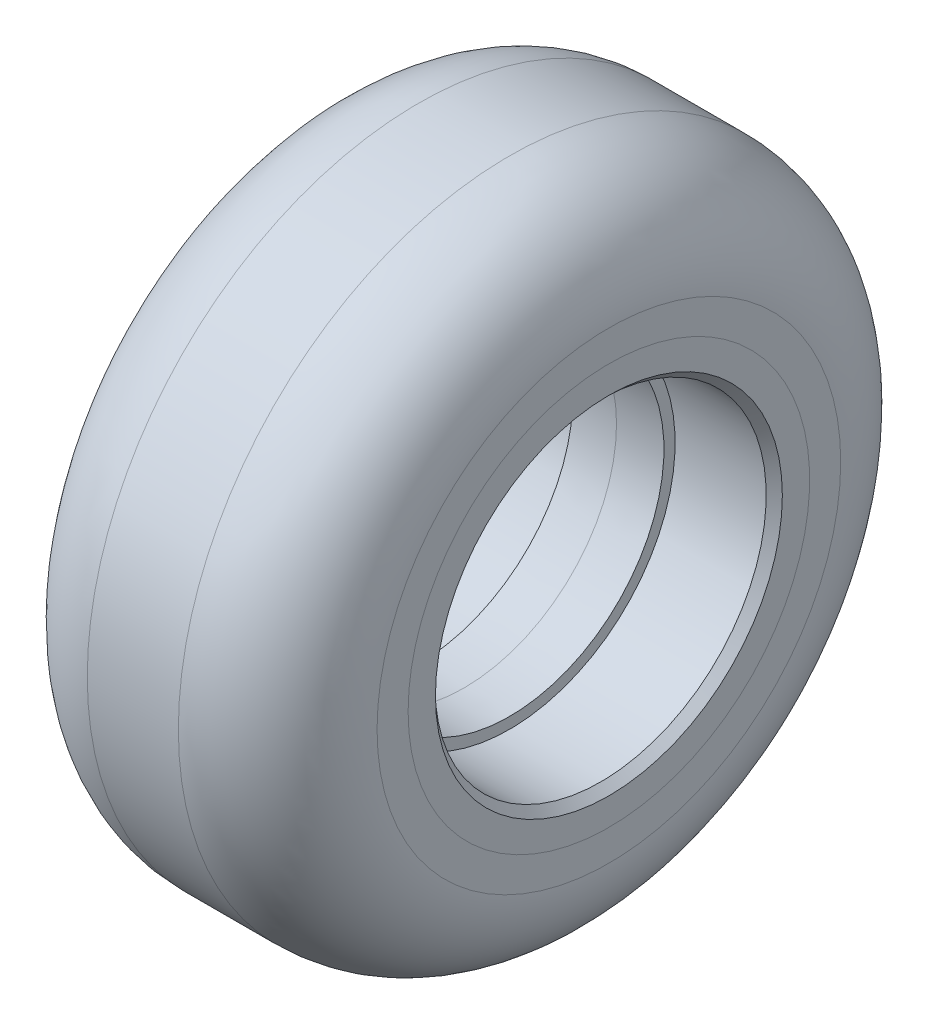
from build123d import *


with BuildPart() as part:
    # Sketch 1 → Revolve 1 (revolve)
    with BuildSketch(Plane(origin=(0, 0, 0), x_dir=(1, 0, 0), z_dir=(0, 1, 0)), mode=Mode.PRIVATE) as revolve_1_sk:
        Polygon((-17.5, 24.25), (-17.5, 20.95), (-16.5, 20), (-5.5, 20), (-5.5, 18.65), (0, 18.420833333), (5.5, 18.65), (5.5, 20), (16.5, 20), (17.5, 20.95), (17.5, 24.25), (0, 25), align=None)
    revolve(revolve_1_sk.sketch.rotate(Axis((-22.315889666, 0, 0), (1, 0, 0)), 180), axis=Axis((-22.315889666, 0, 0), (1, 0, 0)))


with BuildPart() as body_2:
    # Sketch 2 → Revolve 2 (revolve)
    with BuildSketch(Plane(origin=(0, 0, 0), x_dir=(1, 0, 0), z_dir=(0, 1, 0)), mode=Mode.PRIVATE) as revolve_2_sk:
        with BuildLine():
            Line((-5.5, 40), (5.5, 40))
            ThreePointArc((5.5, 40), (13.985281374, 36.485281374), (17.5, 28))
            Line((17.5, 28), (17.5, 24.25))
            Line((17.5, 24.25), (0, 25))
            Line((0, 25), (-17.5, 24.25))
            Line((-17.5, 24.25), (-17.5, 28))
            ThreePointArc((-17.5, 28), (-13.985281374, 36.485281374), (-5.5, 40))
        make_face()
    revolve(revolve_2_sk.sketch.rotate(Axis((-22.315889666, 0, 0), (1, 0, 0)), 180), axis=Axis((-22.315889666, 0, 0), (1, 0, 0)))


solid = Compound([part.part, body_2.part])
